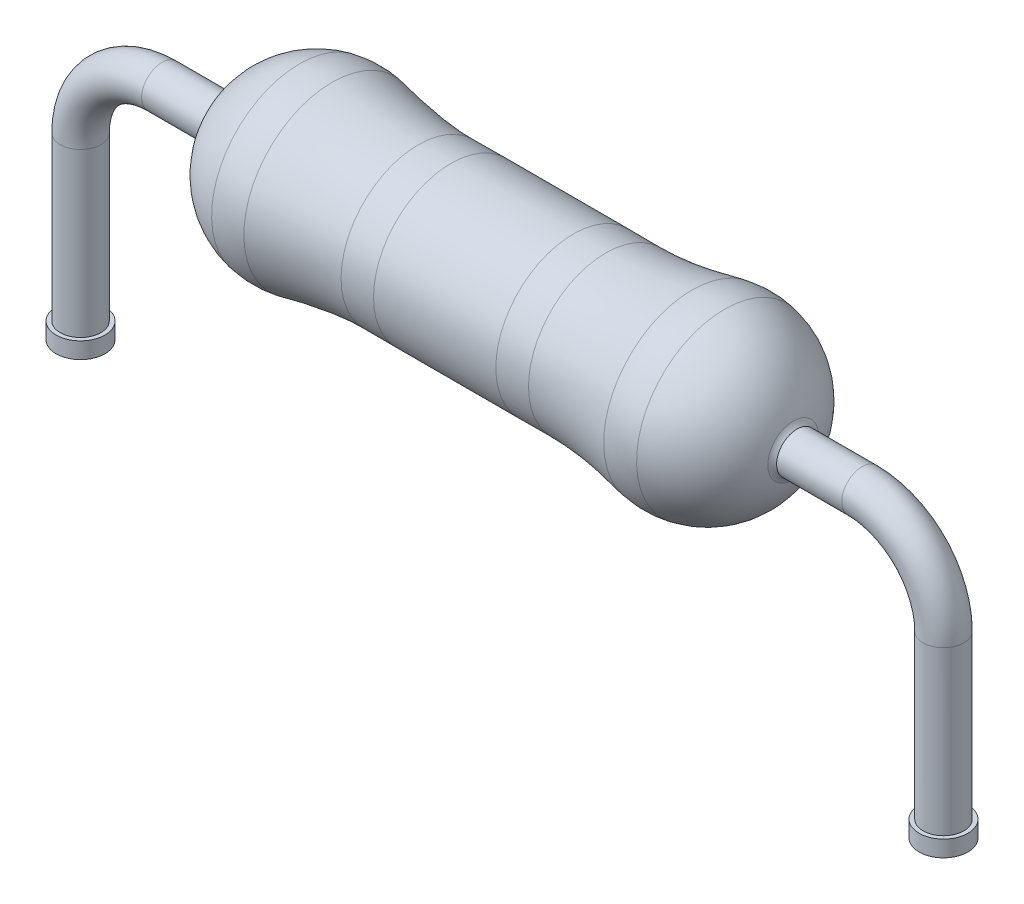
ISO-10303-21;
HEADER;
FILE_DESCRIPTION(('STEP AP214'),'2;1');
FILE_NAME('part.step','',(''),(''),'','','');
FILE_SCHEMA(('AUTOMOTIVE_DESIGN { 1 0 10303 214 1 1 1 1 }'));
ENDSEC;
DATA;
#1=APPLICATION_CONTEXT('core data for automotive mechanical design processes');
#2=APPLICATION_PROTOCOL_DEFINITION('international standard','automotive_design',2000,#1);
#3=PRODUCT_CONTEXT('',#1,'mechanical');
#4=PRODUCT('Part','Part','',(#3));
#5=PRODUCT_RELATED_PRODUCT_CATEGORY('part','',(#4));
#6=PRODUCT_DEFINITION_FORMATION('','',#4);
#7=PRODUCT_DEFINITION_CONTEXT('part definition',#1,'design');
#8=PRODUCT_DEFINITION('design','',#6,#7);
#9=PRODUCT_DEFINITION_SHAPE('','',#8);
#10=(LENGTH_UNIT() NAMED_UNIT(*) SI_UNIT(.MILLI.,.METRE.));
#11=(NAMED_UNIT(*) PLANE_ANGLE_UNIT() SI_UNIT($,.RADIAN.));
#12=(NAMED_UNIT(*) SI_UNIT($,.STERADIAN.) SOLID_ANGLE_UNIT());
#13=UNCERTAINTY_MEASURE_WITH_UNIT(LENGTH_MEASURE(1.E-05),#10,'distance_accuracy_value','');
#14=(GEOMETRIC_REPRESENTATION_CONTEXT(3) GLOBAL_UNCERTAINTY_ASSIGNED_CONTEXT((#13)) GLOBAL_UNIT_ASSIGNED_CONTEXT((#10,
#11,#12)) REPRESENTATION_CONTEXT('',''));
#15=CARTESIAN_POINT('',(0.,0.,0.));
#16=DIRECTION('',(0.,0.,1.));
#17=DIRECTION('',(1.,0.,0.));
#18=AXIS2_PLACEMENT_3D('',#15,#16,#17);
#19=CARTESIAN_POINT('',(-2.4,0.,0.));
#20=DIRECTION('',(-1.,0.,0.));
#21=DIRECTION('',(0.,1.,0.));
#22=AXIS2_PLACEMENT_3D('',#19,#20,#21);
#23=SPHERICAL_SURFACE('',#22,1.1);
#24=CARTESIAN_POINT('',(-3.45477255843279,0.,0.));
#25=DIRECTION('',(-1.,0.,0.));
#26=DIRECTION('',(0.,0.,1.));
#27=AXIS2_PLACEMENT_3D('',#24,#25,#26);
#28=CIRCLE('',#27,0.312177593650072);
#29=CARTESIAN_POINT('',(-3.45477255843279,0.312177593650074,0.));
#30=VERTEX_POINT('',#29);
#31=EDGE_CURVE('E58',#30,#30,#28,.T.);
#32=CARTESIAN_POINT('',(-2.61008625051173,0.,0.));
#33=DIRECTION('',(1.,0.,0.));
#34=DIRECTION('',(0.,1.,0.));
#35=AXIS2_PLACEMENT_3D('',#32,#33,#34);
#36=CIRCLE('',#35,1.07975171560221);
#37=CARTESIAN_POINT('',(-2.61008625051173,1.07975171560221,0.));
#38=VERTEX_POINT('',#37);
#39=EDGE_CURVE('E10',#38,#38,#36,.T.);
#40=CARTESIAN_POINT('',(-3.45477255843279,0.312177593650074,0.));
#41=CARTESIAN_POINT('',(-3.45122527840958,0.324163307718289,0.));
#42=CARTESIAN_POINT('',(-3.44747353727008,0.336088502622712,0.));
#43=CARTESIAN_POINT('',(-3.43956586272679,0.359804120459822,0.));
#44=CARTESIAN_POINT('',(-3.435409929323,0.371594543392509,0.));
#45=CARTESIAN_POINT('',(-3.42669860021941,0.395026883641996,0.));
#46=CARTESIAN_POINT('',(-3.42214320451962,0.406668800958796,0.));
#47=CARTESIAN_POINT('',(-3.41263827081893,0.429790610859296,0.));
#48=CARTESIAN_POINT('',(-3.40768873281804,0.441270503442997,0.));
#49=CARTESIAN_POINT('',(-3.39740125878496,0.464054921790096,0.));
#50=CARTESIAN_POINT('',(-3.39206332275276,0.475359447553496,0.));
#51=CARTESIAN_POINT('',(-3.38100525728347,0.497779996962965,0.));
#52=CARTESIAN_POINT('',(-3.37528512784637,0.508896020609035,0.));
#53=CARTESIAN_POINT('',(-3.36346932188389,0.530926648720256,0.));
#54=CARTESIAN_POINT('',(-3.3573736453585,0.541841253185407,0.));
#55=CARTESIAN_POINT('',(-3.34481382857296,0.563456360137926,0.));
#56=CARTESIAN_POINT('',(-3.3383496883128,0.574156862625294,0.));
#57=CARTESIAN_POINT('',(-3.32506045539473,0.595331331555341,0.));
#58=CARTESIAN_POINT('',(-3.31823536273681,0.605805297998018,0.));
#59=CARTESIAN_POINT('',(-3.30423215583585,0.626514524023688,0.));
#60=CARTESIAN_POINT('',(-3.29705404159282,0.63674978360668,0.));
#61=CARTESIAN_POINT('',(-3.28235313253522,0.65696970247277,0.));
#62=CARTESIAN_POINT('',(-3.27483033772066,0.666954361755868,0.));
#63=CARTESIAN_POINT('',(-3.25944880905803,0.686661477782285,0.));
#64=CARTESIAN_POINT('',(-3.25159007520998,0.696383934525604,0.));
#65=CARTESIAN_POINT('',(-3.23554580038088,0.715555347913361,0.));
#66=CARTESIAN_POINT('',(-3.22736025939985,0.7250043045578,0.));
#67=CARTESIAN_POINT('',(-3.21067188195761,0.743617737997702,0.));
#68=CARTESIAN_POINT('',(-3.20216904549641,0.752782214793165,0.));
#69=CARTESIAN_POINT('',(-3.18485595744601,0.770816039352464,0.));
#70=CARTESIAN_POINT('',(-3.17604570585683,0.7796853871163,0.));
#71=CARTESIAN_POINT('',(-3.1581280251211,0.797118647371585,0.));
#72=CARTESIAN_POINT('',(-3.14902059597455,0.805682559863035,0.));
#73=CARTESIAN_POINT('',(-3.13051914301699,0.822494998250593,0.));
#74=CARTESIAN_POINT('',(-3.12112511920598,0.830743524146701,0.));
#75=CARTESIAN_POINT('',(-3.10206139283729,0.846915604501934,0.));
#76=CARTESIAN_POINT('',(-3.09239169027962,0.854839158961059,0.));
#77=CARTESIAN_POINT('',(-3.07278784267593,0.870352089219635,0.));
#78=CARTESIAN_POINT('',(-3.06285369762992,0.877941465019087,0.));
#79=CARTESIAN_POINT('',(-3.04273250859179,0.892777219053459,0.));
#80=CARTESIAN_POINT('',(-3.03254546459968,0.900023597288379,0.));
#81=CARTESIAN_POINT('',(-3.01193031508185,0.914164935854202,0.));
#82=CARTESIAN_POINT('',(-3.00150220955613,0.921059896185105,0.));
#83=CARTESIAN_POINT('',(-2.98041705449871,0.934490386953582,0.));
#84=CARTESIAN_POINT('',(-2.96976000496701,0.941025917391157,0.));
#85=CARTESIAN_POINT('',(-2.9482293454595,0.953729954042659,0.));
#86=CARTESIAN_POINT('',(-2.93735573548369,0.959898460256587,0.));
#87=CARTESIAN_POINT('',(-2.91540459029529,0.971861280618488,0.));
#88=CARTESIAN_POINT('',(-2.9043270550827,0.977655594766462,0.));
#89=CARTESIAN_POINT('',(-2.8819809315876,0.988863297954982,0.));
#90=CARTESIAN_POINT('',(-2.87071234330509,0.994276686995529,0.));
#91=CARTESIAN_POINT('',(-2.84799720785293,1.00471624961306,0.));
#92=CARTESIAN_POINT('',(-2.83655066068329,1.00974242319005,0.));
#93=CARTESIAN_POINT('',(-2.81349290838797,1.0194017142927,0.));
#94=CARTESIAN_POINT('',(-2.80188170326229,1.02403483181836,0.));
#95=CARTESIAN_POINT('',(-2.77850812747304,1.03290262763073,0.));
#96=CARTESIAN_POINT('',(-2.76674575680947,1.03713730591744,0.));
#97=CARTESIAN_POINT('',(-2.7430835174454,1.04520330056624,0.));
#98=CARTESIAN_POINT('',(-2.7311836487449,1.04903461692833,0.));
#99=CARTESIAN_POINT('',(-2.70726024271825,1.05628944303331,0.));
#100=CARTESIAN_POINT('',(-2.6952367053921,1.05971295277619,0.));
#101=CARTESIAN_POINT('',(-2.67107992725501,1.06614816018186,0.));
#102=CARTESIAN_POINT('',(-2.65894668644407,1.06915985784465,0.));
#103=CARTESIAN_POINT('',(-2.63458462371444,1.07476804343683,0.));
#104=CARTESIAN_POINT('',(-2.62235580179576,1.07736453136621,0.));
#105=CARTESIAN_POINT('',(-2.61008625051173,1.07975171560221,0.));
#106=B_SPLINE_CURVE_WITH_KNOTS('',3,(#40,#41,#42,#43,#44,#45,#46,#47,#48,#49,#50,#51,#52,#53,
#54,#55,#56,#57,#58,#59,#60,#61,#62,#63,#64,#65,#66,#67,#68,#69,#70,#71,#72,#73,#74,#75,#76,#77,
#78,#79,#80,#81,#82,#83,#84,#85,#86,#87,#88,#89,#90,#91,#92,#93,#94,#95,#96,#97,#98,#99,#100,
#101,#102,#103,#104,#105),.UNSPECIFIED.,.F.,.F.,(4,2,2,2,2,2,2,2,2,2,2,2,2,2,2,2,2,2,2,2,2,2,2,
2,2,2,2,2,2,2,2,2,4),(0.,0.0374970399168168,0.0749940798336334,0.11249111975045,
0.149988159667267,0.187485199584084,0.2249822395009,0.262479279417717,0.299976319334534,
0.337473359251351,0.374970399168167,0.412467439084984,0.449964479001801,0.487461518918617,
0.524958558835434,0.562455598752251,0.599952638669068,0.637449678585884,0.674946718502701,
0.712443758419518,0.749940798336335,0.787437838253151,0.824934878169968,0.862431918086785,
0.899928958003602,0.937425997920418,0.974923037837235,1.01242007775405,1.04991711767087,
1.08741415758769,1.1249111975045,1.16240823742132,1.19990527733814),.UNSPECIFIED.);
#107=EDGE_CURVE('BSEAM35',#30,#38,#106,.T.);
#108=ORIENTED_EDGE('',*,*,#31,.F.);
#109=ORIENTED_EDGE('',*,*,#39,.F.);
#110=ORIENTED_EDGE('',*,*,#107,.T.);
#111=ORIENTED_EDGE('',*,*,#107,.F.);
#112=EDGE_LOOP('',(#108,#110,#109,#111));
#113=FACE_BOUND('',#112,.T.);
#114=ADVANCED_FACE('F35',(#113),#23,.T.);
#115=CARTESIAN_POINT('',(-0.751281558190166,0.95,0.));
#116=CARTESIAN_POINT('',(-0.922733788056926,0.954106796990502,0.));
#117=CARTESIAN_POINT('',(-1.41354099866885,0.927963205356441,0.));
#118=CARTESIAN_POINT('',(-1.89811743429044,1.01750246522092,0.));
#119=CARTESIAN_POINT('',(-2.21008625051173,1.08348178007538,0.));
#120=B_SPLINE_CURVE_WITH_KNOTS('',3,(#115,#116,#117,#118,#119),.UNSPECIFIED.,.F.,.F.,(4,1,4),
(0.,0.350784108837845,1.),.UNSPECIFIED.);
#121=CARTESIAN_POINT('',(-6.2236838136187,0.,0.));
#122=DIRECTION('',(-1.,0.,0.));
#123=AXIS1_PLACEMENT('',#121,#122);
#124=SURFACE_OF_REVOLUTION('',#120,#123);
#125=CARTESIAN_POINT('',(-2.21008625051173,0.,0.));
#126=DIRECTION('',(-1.,0.,0.));
#127=DIRECTION('',(0.,0.,1.));
#128=AXIS2_PLACEMENT_3D('',#125,#126,#127);
#129=CIRCLE('',#128,1.08348178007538);
#130=CARTESIAN_POINT('',(-2.21008625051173,1.08348178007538,0.));
#131=VERTEX_POINT('',#130);
#132=EDGE_CURVE('E63',#131,#131,#129,.T.);
#133=ORIENTED_EDGE('',*,*,#132,.F.);
#134=EDGE_LOOP('',(#133));
#135=FACE_BOUND('',#134,.T.);
#136=CARTESIAN_POINT('',(-1.15128155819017,0.,0.));
#137=DIRECTION('',(-1.,0.,0.));
#138=DIRECTION('',(0.,0.,1.));
#139=AXIS2_PLACEMENT_3D('',#136,#137,#138);
#140=CIRCLE('',#139,0.948430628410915);
#141=CARTESIAN_POINT('',(-1.15128155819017,0.,0.948430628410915));
#142=VERTEX_POINT('',#141);
#143=EDGE_CURVE('E45',#142,#142,#140,.F.);
#144=ORIENTED_EDGE('',*,*,#143,.F.);
#145=EDGE_LOOP('',(#144));
#146=FACE_BOUND('',#145,.T.);
#147=ADVANCED_FACE('F113',(#135,#146),#124,.T.);
#148=CARTESIAN_POINT('',(2.21008625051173,1.08348178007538,0.));
#149=CARTESIAN_POINT('',(1.89811743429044,1.01750246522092,0.));
#150=CARTESIAN_POINT('',(1.41354099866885,0.927963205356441,0.));
#151=CARTESIAN_POINT('',(0.922733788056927,0.954106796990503,0.));
#152=CARTESIAN_POINT('',(0.751281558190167,0.95,0.));
#153=B_SPLINE_CURVE_WITH_KNOTS('',3,(#148,#149,#150,#151,#152),.UNSPECIFIED.,.F.,.F.,(4,1,4),
(0.,0.649215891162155,1.),.UNSPECIFIED.);
#154=CARTESIAN_POINT('',(-6.2236838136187,0.,0.));
#155=DIRECTION('',(-1.,0.,0.));
#156=AXIS1_PLACEMENT('',#154,#155);
#157=SURFACE_OF_REVOLUTION('',#153,#156);
#158=CARTESIAN_POINT('',(2.21008625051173,0.,0.));
#159=DIRECTION('',(-1.,0.,0.));
#160=DIRECTION('',(0.,0.,1.));
#161=AXIS2_PLACEMENT_3D('',#158,#159,#160);
#162=CIRCLE('',#161,1.08348178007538);
#163=CARTESIAN_POINT('',(2.21008625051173,1.08348178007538,0.));
#164=VERTEX_POINT('',#163);
#165=EDGE_CURVE('E146',#164,#164,#162,.T.);
#166=ORIENTED_EDGE('',*,*,#165,.T.);
#167=EDGE_LOOP('',(#166));
#168=FACE_BOUND('',#167,.T.);
#169=CARTESIAN_POINT('',(1.15128155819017,0.,0.));
#170=DIRECTION('',(-1.,0.,0.));
#171=DIRECTION('',(0.,0.,1.));
#172=AXIS2_PLACEMENT_3D('',#169,#170,#171);
#173=CIRCLE('',#172,0.948430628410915);
#174=CARTESIAN_POINT('',(1.15128155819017,0.,0.948430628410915));
#175=VERTEX_POINT('',#174);
#176=EDGE_CURVE('E53',#175,#175,#173,.T.);
#177=ORIENTED_EDGE('',*,*,#176,.F.);
#178=EDGE_LOOP('',(#177));
#179=FACE_BOUND('',#178,.T.);
#180=ADVANCED_FACE('F99',(#168,#179),#157,.T.);
#181=CARTESIAN_POINT('',(2.4,0.,0.));
#182=DIRECTION('',(-1.,0.,0.));
#183=DIRECTION('',(0.,1.,0.));
#184=AXIS2_PLACEMENT_3D('',#181,#182,#183);
#185=SPHERICAL_SURFACE('',#184,1.1);
#186=CARTESIAN_POINT('',(3.45477255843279,0.,0.));
#187=DIRECTION('',(-1.,0.,0.));
#188=DIRECTION('',(0.,0.,1.));
#189=AXIS2_PLACEMENT_3D('',#186,#187,#188);
#190=CIRCLE('',#189,0.312177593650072);
#191=CARTESIAN_POINT('',(3.45477255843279,0.312177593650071,0.));
#192=VERTEX_POINT('',#191);
#193=EDGE_CURVE('E149',#192,#192,#190,.T.);
#194=CARTESIAN_POINT('',(2.61008625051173,0.,0.));
#195=DIRECTION('',(-1.,0.,0.));
#196=DIRECTION('',(0.,-1.,0.));
#197=AXIS2_PLACEMENT_3D('',#194,#195,#196);
#198=CIRCLE('',#197,1.07975171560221);
#199=CARTESIAN_POINT('',(2.61008625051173,1.07975171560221,0.));
#200=VERTEX_POINT('',#199);
#201=EDGE_CURVE('E152',#200,#200,#198,.T.);
#202=CARTESIAN_POINT('',(3.45477255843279,0.312177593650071,0.));
#203=CARTESIAN_POINT('',(3.45122527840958,0.324163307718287,0.));
#204=CARTESIAN_POINT('',(3.44747353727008,0.33608850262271,0.));
#205=CARTESIAN_POINT('',(3.43956586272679,0.35980412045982,0.));
#206=CARTESIAN_POINT('',(3.435409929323,0.371594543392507,0.));
#207=CARTESIAN_POINT('',(3.42669860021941,0.395026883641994,0.));
#208=CARTESIAN_POINT('',(3.42214320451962,0.406668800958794,0.));
#209=CARTESIAN_POINT('',(3.41263827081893,0.429790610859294,0.));
#210=CARTESIAN_POINT('',(3.40768873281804,0.441270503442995,0.));
#211=CARTESIAN_POINT('',(3.39740125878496,0.464054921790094,0.));
#212=CARTESIAN_POINT('',(3.39206332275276,0.475359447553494,0.));
#213=CARTESIAN_POINT('',(3.38100525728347,0.497779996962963,0.));
#214=CARTESIAN_POINT('',(3.37528512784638,0.508896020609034,0.));
#215=CARTESIAN_POINT('',(3.36346932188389,0.530926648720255,0.));
#216=CARTESIAN_POINT('',(3.3573736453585,0.541841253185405,0.));
#217=CARTESIAN_POINT('',(3.34481382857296,0.563456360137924,0.));
#218=CARTESIAN_POINT('',(3.3383496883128,0.574156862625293,0.));
#219=CARTESIAN_POINT('',(3.32506045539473,0.595331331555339,0.));
#220=CARTESIAN_POINT('',(3.31823536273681,0.605805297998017,0.));
#221=CARTESIAN_POINT('',(3.30423215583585,0.626514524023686,0.));
#222=CARTESIAN_POINT('',(3.29705404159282,0.636749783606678,0.));
#223=CARTESIAN_POINT('',(3.28235313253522,0.656969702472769,0.));
#224=CARTESIAN_POINT('',(3.27483033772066,0.666954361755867,0.));
#225=CARTESIAN_POINT('',(3.25944880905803,0.686661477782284,0.));
#226=CARTESIAN_POINT('',(3.25159007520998,0.696383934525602,0.));
#227=CARTESIAN_POINT('',(3.23554580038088,0.71555534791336,0.));
#228=CARTESIAN_POINT('',(3.22736025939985,0.725004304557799,0.));
#229=CARTESIAN_POINT('',(3.21067188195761,0.743617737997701,0.));
#230=CARTESIAN_POINT('',(3.20216904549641,0.752782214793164,0.));
#231=CARTESIAN_POINT('',(3.18485595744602,0.770816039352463,0.));
#232=CARTESIAN_POINT('',(3.17604570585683,0.779685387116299,0.));
#233=CARTESIAN_POINT('',(3.1581280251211,0.797118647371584,0.));
#234=CARTESIAN_POINT('',(3.14902059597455,0.805682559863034,0.));
#235=CARTESIAN_POINT('',(3.13051914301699,0.822494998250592,0.));
#236=CARTESIAN_POINT('',(3.12112511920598,0.8307435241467,0.));
#237=CARTESIAN_POINT('',(3.1020613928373,0.846915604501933,0.));
#238=CARTESIAN_POINT('',(3.09239169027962,0.854839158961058,0.));
#239=CARTESIAN_POINT('',(3.07278784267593,0.870352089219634,0.));
#240=CARTESIAN_POINT('',(3.06285369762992,0.877941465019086,0.));
#241=CARTESIAN_POINT('',(3.04273250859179,0.892777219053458,0.));
#242=CARTESIAN_POINT('',(3.03254546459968,0.900023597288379,0.));
#243=CARTESIAN_POINT('',(3.01193031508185,0.914164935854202,0.));
#244=CARTESIAN_POINT('',(3.00150220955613,0.921059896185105,0.));
#245=CARTESIAN_POINT('',(2.98041705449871,0.934490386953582,0.));
#246=CARTESIAN_POINT('',(2.96976000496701,0.941025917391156,0.));
#247=CARTESIAN_POINT('',(2.9482293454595,0.953729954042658,0.));
#248=CARTESIAN_POINT('',(2.93735573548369,0.959898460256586,0.));
#249=CARTESIAN_POINT('',(2.91540459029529,0.971861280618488,0.));
#250=CARTESIAN_POINT('',(2.9043270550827,0.977655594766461,0.));
#251=CARTESIAN_POINT('',(2.8819809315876,0.988863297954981,0.));
#252=CARTESIAN_POINT('',(2.87071234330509,0.994276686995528,0.));
#253=CARTESIAN_POINT('',(2.84799720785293,1.00471624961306,0.));
#254=CARTESIAN_POINT('',(2.83655066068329,1.00974242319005,0.));
#255=CARTESIAN_POINT('',(2.81349290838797,1.0194017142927,0.));
#256=CARTESIAN_POINT('',(2.80188170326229,1.02403483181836,0.));
#257=CARTESIAN_POINT('',(2.77850812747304,1.03290262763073,0.));
#258=CARTESIAN_POINT('',(2.76674575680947,1.03713730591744,0.));
#259=CARTESIAN_POINT('',(2.7430835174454,1.04520330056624,0.));
#260=CARTESIAN_POINT('',(2.7311836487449,1.04903461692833,0.));
#261=CARTESIAN_POINT('',(2.70726024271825,1.05628944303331,0.));
#262=CARTESIAN_POINT('',(2.6952367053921,1.05971295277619,0.));
#263=CARTESIAN_POINT('',(2.67107992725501,1.06614816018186,0.));
#264=CARTESIAN_POINT('',(2.65894668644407,1.06915985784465,0.));
#265=CARTESIAN_POINT('',(2.63458462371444,1.07476804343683,0.));
#266=CARTESIAN_POINT('',(2.62235580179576,1.07736453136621,0.));
#267=CARTESIAN_POINT('',(2.61008625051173,1.07975171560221,0.));
#268=B_SPLINE_CURVE_WITH_KNOTS('',3,(#202,#203,#204,#205,#206,#207,#208,#209,#210,#211,#212,
#213,#214,#215,#216,#217,#218,#219,#220,#221,#222,#223,#224,#225,#226,#227,#228,#229,#230,#231,
#232,#233,#234,#235,#236,#237,#238,#239,#240,#241,#242,#243,#244,#245,#246,#247,#248,#249,#250,
#251,#252,#253,#254,#255,#256,#257,#258,#259,#260,#261,#262,#263,#264,#265,#266,#267),
.UNSPECIFIED.,.F.,.F.,(4,2,2,2,2,2,2,2,2,2,2,2,2,2,2,2,2,2,2,2,2,2,2,2,2,2,2,2,2,2,2,2,4),(0.,
0.0374970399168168,0.0749940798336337,0.11249111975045,0.149988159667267,0.187485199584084,
0.224982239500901,0.262479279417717,0.299976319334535,0.337473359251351,0.374970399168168,
0.412467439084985,0.449964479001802,0.487461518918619,0.524958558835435,0.562455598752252,
0.599952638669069,0.637449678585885,0.674946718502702,0.712443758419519,0.749940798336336,
0.787437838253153,0.824934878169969,0.862431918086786,0.899928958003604,0.93742599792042,
0.974923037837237,1.01242007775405,1.04991711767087,1.08741415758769,1.1249111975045,
1.16240823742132,1.19990527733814),.UNSPECIFIED.);
#269=EDGE_CURVE('BSEAM103',#192,#200,#268,.T.);
#270=ORIENTED_EDGE('',*,*,#193,.T.);
#271=ORIENTED_EDGE('',*,*,#201,.F.);
#272=ORIENTED_EDGE('',*,*,#269,.T.);
#273=ORIENTED_EDGE('',*,*,#269,.F.);
#274=EDGE_LOOP('',(#270,#272,#271,#273));
#275=FACE_BOUND('',#274,.T.);
#276=ADVANCED_FACE('F103',(#275),#185,.T.);
#277=CARTESIAN_POINT('',(3.5,0.250000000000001,0.));
#278=CARTESIAN_POINT('',(3.47134460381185,0.276701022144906,0.));
#279=CARTESIAN_POINT('',(3.45477255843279,0.312177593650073,0.));
#280=B_SPLINE_CURVE_WITH_KNOTS('',2,(#277,#278,#279),.UNSPECIFIED.,.F.,.F.,(3,3),(0.,1.),.UNSPECIFIED.);
#281=CARTESIAN_POINT('',(-6.2236838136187,0.,0.));
#282=DIRECTION('',(-1.,0.,0.));
#283=AXIS1_PLACEMENT('',#281,#282);
#284=SURFACE_OF_REVOLUTION('',#280,#283);
#285=ORIENTED_EDGE('',*,*,#193,.F.);
#286=EDGE_LOOP('',(#285));
#287=FACE_BOUND('',#286,.T.);
#288=CARTESIAN_POINT('',(3.5,0.,0.));
#289=DIRECTION('',(1.,0.,0.));
#290=DIRECTION('',(0.,0.,-1.));
#291=AXIS2_PLACEMENT_3D('',#288,#289,#290);
#292=CIRCLE('',#291,0.25);
#293=CARTESIAN_POINT('',(3.5,0.,-0.25));
#294=VERTEX_POINT('',#293);
#295=EDGE_CURVE('E40',#294,#294,#292,.T.);
#296=ORIENTED_EDGE('',*,*,#295,.F.);
#297=EDGE_LOOP('',(#296));
#298=FACE_BOUND('',#297,.T.);
#299=ADVANCED_FACE('F37',(#287,#298),#284,.T.);
#300=CARTESIAN_POINT('',(2.61008625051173,1.07975171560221,0.));
#301=CARTESIAN_POINT('',(2.60597322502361,1.08055198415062,0.));
#302=CARTESIAN_POINT('',(2.6018556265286,1.08132874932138,0.));
#303=CARTESIAN_POINT('',(2.59361182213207,1.08283517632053,0.));
#304=CARTESIAN_POINT('',(2.58948561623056,1.08356483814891,0.));
#305=CARTESIAN_POINT('',(2.58122513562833,1.08497696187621,0.));
#306=CARTESIAN_POINT('',(2.57709086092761,1.08565942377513,0.));
#307=CARTESIAN_POINT('',(2.56881478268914,1.0869770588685,0.));
#308=CARTESIAN_POINT('',(2.5646729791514,1.08761223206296,0.));
#309=CARTESIAN_POINT('',(2.55638238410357,1.08883520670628,0.));
#310=CARTESIAN_POINT('',(2.55223359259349,1.08942300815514,0.));
#311=CARTESIAN_POINT('',(2.54392956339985,1.09055116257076,0.));
#312=CARTESIAN_POINT('',(2.53977432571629,1.09109151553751,0.));
#313=CARTESIAN_POINT('',(2.5314579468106,1.09212470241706,0.));
#314=CARTESIAN_POINT('',(2.52729680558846,1.09261753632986,0.));
#315=CARTESIAN_POINT('',(2.51896916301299,1.09355562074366,0.));
#316=CARTESIAN_POINT('',(2.51480266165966,1.09400087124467,0.));
#317=CARTESIAN_POINT('',(2.50646484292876,1.09484373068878,0.));
#318=CARTESIAN_POINT('',(2.50229352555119,1.09524133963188,0.));
#319=CARTESIAN_POINT('',(2.49394661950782,1.09598886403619,0.));
#320=CARTESIAN_POINT('',(2.48977103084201,1.09633877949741,0.));
#321=CARTESIAN_POINT('',(2.48141612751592,1.09699087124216,0.));
#322=CARTESIAN_POINT('',(2.47723681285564,1.09729304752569,0.));
#323=CARTESIAN_POINT('',(2.46887500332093,1.09784962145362,0.));
#324=CARTESIAN_POINT('',(2.46469250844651,1.09810401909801,0.));
#325=CARTESIAN_POINT('',(2.4563248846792,1.09856500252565,0.));
#326=CARTESIAN_POINT('',(2.4521397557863,1.0987715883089,0.));
#327=CARTESIAN_POINT('',(2.44376741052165,1.09913692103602,0.));
#328=CARTESIAN_POINT('',(2.43958019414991,1.0992956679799,0.));
#329=CARTESIAN_POINT('',(2.4312042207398,1.09956530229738,0.));
#330=CARTESIAN_POINT('',(2.42701546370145,1.09967618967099,0.));
#331=CARTESIAN_POINT('',(2.41863695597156,1.09985009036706,0.));
#332=CARTESIAN_POINT('',(2.41444720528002,1.09991310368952,0.));
#333=CARTESIAN_POINT('',(2.40606725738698,1.09999124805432,0.));
#334=CARTESIAN_POINT('',(2.40187706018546,1.10000637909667,0.));
#335=CARTESIAN_POINT('',(2.39349676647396,1.09998875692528,0.));
#336=CARTESIAN_POINT('',(2.38930666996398,1.09995600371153,0.));
#337=CARTESIAN_POINT('',(2.38092712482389,1.09984261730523,0.));
#338=CARTESIAN_POINT('',(2.37673767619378,1.09976198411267,0.));
#339=CARTESIAN_POINT('',(2.36835997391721,1.09955284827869,0.));
#340=CARTESIAN_POINT('',(2.36417172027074,1.09942434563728,0.));
#341=CARTESIAN_POINT('',(2.35579695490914,1.09911948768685,0.));
#342=CARTESIAN_POINT('',(2.351610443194,1.09894313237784,0.));
#343=CARTESIAN_POINT('',(2.34323970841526,1.09854259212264,0.));
#344=CARTESIAN_POINT('',(2.33905548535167,1.09831840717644,0.));
#345=CARTESIAN_POINT('',(2.33068987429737,1.09782223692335,0.));
#346=CARTESIAN_POINT('',(2.32650848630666,1.09755025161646,0.));
#347=CARTESIAN_POINT('',(2.31814909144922,1.09695851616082,0.));
#348=CARTESIAN_POINT('',(2.3139710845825,1.09663876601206,0.));
#349=CARTESIAN_POINT('',(2.30561899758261,1.09595154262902,0.));
#350=CARTESIAN_POINT('',(2.30144491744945,1.09558406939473,0.));
#351=CARTESIAN_POINT('',(2.29310122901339,1.09480144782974,0.));
#352=CARTESIAN_POINT('',(2.28893162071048,1.09438629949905,0.));
#353=CARTESIAN_POINT('',(2.28059742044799,1.09350838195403,0.));
#354=CARTESIAN_POINT('',(2.27643282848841,1.09304561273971,0.));
#355=CARTESIAN_POINT('',(2.26810920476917,1.0920725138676,0.));
#356=CARTESIAN_POINT('',(2.26395017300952,1.09156218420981,0.));
#357=CARTESIAN_POINT('',(2.25563821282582,1.09049403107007,0.));
#358=CARTESIAN_POINT('',(2.25148528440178,1.08993620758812,0.));
#359=CARTESIAN_POINT('',(2.24318607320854,1.08877313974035,0.));
#360=CARTESIAN_POINT('',(2.23903979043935,1.08816789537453,0.));
#361=CARTESIAN_POINT('',(2.23075441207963,1.08691006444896,0.));
#362=CARTESIAN_POINT('',(2.2266153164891,1.08625747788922,0.));
#363=CARTESIAN_POINT('',(2.21834485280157,1.08490504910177,0.));
#364=CARTESIAN_POINT('',(2.21421348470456,1.08420520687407,0.));
#365=CARTESIAN_POINT('',(2.21008625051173,1.08348178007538,0.));
#366=B_SPLINE_CURVE_WITH_KNOTS('',3,(#300,#301,#302,#303,#304,#305,#306,#307,#308,#309,#310,
#311,#312,#313,#314,#315,#316,#317,#318,#319,#320,#321,#322,#323,#324,#325,#326,#327,#328,#329,
#330,#331,#332,#333,#334,#335,#336,#337,#338,#339,#340,#341,#342,#343,#344,#345,#346,#347,#348,
#349,#350,#351,#352,#353,#354,#355,#356,#357,#358,#359,#360,#361,#362,#363,#364,#365),
.UNSPECIFIED.,.F.,.F.,(4,2,2,2,2,2,2,2,2,2,2,2,2,2,2,2,2,2,2,2,2,2,2,2,2,2,2,2,2,2,2,2,4),(0.,
0.0125703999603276,0.0251407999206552,0.0377111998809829,0.0502815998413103,0.0628519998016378,
0.0754223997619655,0.087992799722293,0.10056319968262,0.113133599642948,0.125703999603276,
0.138274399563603,0.150844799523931,0.163415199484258,0.175985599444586,0.188555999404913,
0.201126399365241,0.213696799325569,0.226267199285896,0.238837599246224,0.251407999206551,
0.263978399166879,0.276548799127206,0.289119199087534,0.301689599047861,0.314259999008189,
0.326830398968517,0.339400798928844,0.351971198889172,0.364541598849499,0.377111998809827,
0.389682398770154,0.402252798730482),.UNSPECIFIED.);
#367=EDGE_CURVE('BSEAM97',#200,#164,#366,.T.);
#368=ORIENTED_EDGE('',*,*,#201,.T.);
#369=ORIENTED_EDGE('',*,*,#165,.F.);
#370=ORIENTED_EDGE('',*,*,#367,.T.);
#371=ORIENTED_EDGE('',*,*,#367,.F.);
#372=EDGE_LOOP('',(#368,#370,#369,#371));
#373=FACE_BOUND('',#372,.T.);
#374=ADVANCED_FACE('F97',(#373),#185,.T.);
#375=ORIENTED_EDGE('',*,*,#176,.T.);
#376=EDGE_LOOP('',(#375));
#377=FACE_BOUND('',#376,.T.);
#378=CARTESIAN_POINT('',(0.751281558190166,0.,0.));
#379=DIRECTION('',(-1.,0.,0.));
#380=DIRECTION('',(0.,0.,1.));
#381=AXIS2_PLACEMENT_3D('',#378,#379,#380);
#382=CIRCLE('',#381,0.95);
#383=CARTESIAN_POINT('',(0.751281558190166,0.,0.95));
#384=VERTEX_POINT('',#383);
#385=EDGE_CURVE('E141',#384,#384,#382,.T.);
#386=ORIENTED_EDGE('',*,*,#385,.F.);
#387=EDGE_LOOP('',(#386));
#388=FACE_BOUND('',#387,.T.);
#389=ADVANCED_FACE('F93',(#377,#388),#157,.T.);
#390=CARTESIAN_POINT('',(-6.2236838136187,0.,0.));
#391=DIRECTION('',(-1.,0.,0.));
#392=DIRECTION('',(0.,0.,1.));
#393=AXIS2_PLACEMENT_3D('',#390,#391,#392);
#394=CYLINDRICAL_SURFACE('',#393,0.95);
#395=CARTESIAN_POINT('',(-0.751281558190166,0.,0.));
#396=DIRECTION('',(-1.,0.,0.));
#397=DIRECTION('',(0.,0.,1.));
#398=AXIS2_PLACEMENT_3D('',#395,#396,#397);
#399=CIRCLE('',#398,0.95);
#400=CARTESIAN_POINT('',(-0.751281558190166,0.,0.95));
#401=VERTEX_POINT('',#400);
#402=EDGE_CURVE('E138',#401,#401,#399,.T.);
#403=ORIENTED_EDGE('',*,*,#402,.F.);
#404=EDGE_LOOP('',(#403));
#405=FACE_BOUND('',#404,.T.);
#406=ORIENTED_EDGE('',*,*,#385,.T.);
#407=EDGE_LOOP('',(#406));
#408=FACE_BOUND('',#407,.T.);
#409=ADVANCED_FACE('F96',(#405,#408),#394,.T.);
#410=ORIENTED_EDGE('',*,*,#143,.T.);
#411=EDGE_LOOP('',(#410));
#412=FACE_BOUND('',#411,.T.);
#413=ORIENTED_EDGE('',*,*,#402,.T.);
#414=EDGE_LOOP('',(#413));
#415=FACE_BOUND('',#414,.T.);
#416=ADVANCED_FACE('F121',(#412,#415),#124,.T.);
#417=CARTESIAN_POINT('',(-2.61008625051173,1.07975171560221,0.));
#418=CARTESIAN_POINT('',(-2.60597322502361,1.08055198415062,0.));
#419=CARTESIAN_POINT('',(-2.6018556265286,1.08132874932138,0.));
#420=CARTESIAN_POINT('',(-2.59361182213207,1.08283517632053,0.));
#421=CARTESIAN_POINT('',(-2.58948561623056,1.08356483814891,0.));
#422=CARTESIAN_POINT('',(-2.58122513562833,1.08497696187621,0.));
#423=CARTESIAN_POINT('',(-2.57709086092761,1.08565942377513,0.));
#424=CARTESIAN_POINT('',(-2.56881478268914,1.0869770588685,0.));
#425=CARTESIAN_POINT('',(-2.5646729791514,1.08761223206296,0.));
#426=CARTESIAN_POINT('',(-2.55638238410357,1.08883520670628,0.));
#427=CARTESIAN_POINT('',(-2.55223359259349,1.08942300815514,0.));
#428=CARTESIAN_POINT('',(-2.54392956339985,1.09055116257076,0.));
#429=CARTESIAN_POINT('',(-2.53977432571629,1.09109151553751,0.));
#430=CARTESIAN_POINT('',(-2.5314579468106,1.09212470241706,0.));
#431=CARTESIAN_POINT('',(-2.52729680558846,1.09261753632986,0.));
#432=CARTESIAN_POINT('',(-2.51896916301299,1.09355562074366,0.));
#433=CARTESIAN_POINT('',(-2.51480266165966,1.09400087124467,0.));
#434=CARTESIAN_POINT('',(-2.50646484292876,1.09484373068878,0.));
#435=CARTESIAN_POINT('',(-2.50229352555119,1.09524133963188,0.));
#436=CARTESIAN_POINT('',(-2.49394661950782,1.09598886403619,0.));
#437=CARTESIAN_POINT('',(-2.48977103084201,1.09633877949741,0.));
#438=CARTESIAN_POINT('',(-2.48141612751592,1.09699087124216,0.));
#439=CARTESIAN_POINT('',(-2.47723681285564,1.09729304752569,0.));
#440=CARTESIAN_POINT('',(-2.46887500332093,1.09784962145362,0.));
#441=CARTESIAN_POINT('',(-2.46469250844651,1.09810401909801,0.));
#442=CARTESIAN_POINT('',(-2.45632488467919,1.09856500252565,0.));
#443=CARTESIAN_POINT('',(-2.4521397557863,1.0987715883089,0.));
#444=CARTESIAN_POINT('',(-2.44376741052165,1.09913692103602,0.));
#445=CARTESIAN_POINT('',(-2.43958019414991,1.0992956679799,0.));
#446=CARTESIAN_POINT('',(-2.4312042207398,1.09956530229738,0.));
#447=CARTESIAN_POINT('',(-2.42701546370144,1.09967618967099,0.));
#448=CARTESIAN_POINT('',(-2.41863695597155,1.09985009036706,0.));
#449=CARTESIAN_POINT('',(-2.41444720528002,1.09991310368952,0.));
#450=CARTESIAN_POINT('',(-2.40606725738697,1.09999124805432,0.));
#451=CARTESIAN_POINT('',(-2.40187706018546,1.10000637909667,0.));
#452=CARTESIAN_POINT('',(-2.39349676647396,1.09998875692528,0.));
#453=CARTESIAN_POINT('',(-2.38930666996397,1.09995600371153,0.));
#454=CARTESIAN_POINT('',(-2.38092712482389,1.09984261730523,0.));
#455=CARTESIAN_POINT('',(-2.37673767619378,1.09976198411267,0.));
#456=CARTESIAN_POINT('',(-2.36835997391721,1.09955284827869,0.));
#457=CARTESIAN_POINT('',(-2.36417172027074,1.09942434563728,0.));
#458=CARTESIAN_POINT('',(-2.35579695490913,1.09911948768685,0.));
#459=CARTESIAN_POINT('',(-2.351610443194,1.09894313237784,0.));
#460=CARTESIAN_POINT('',(-2.34323970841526,1.09854259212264,0.));
#461=CARTESIAN_POINT('',(-2.33905548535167,1.09831840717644,0.));
#462=CARTESIAN_POINT('',(-2.33068987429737,1.09782223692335,0.));
#463=CARTESIAN_POINT('',(-2.32650848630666,1.09755025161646,0.));
#464=CARTESIAN_POINT('',(-2.31814909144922,1.09695851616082,0.));
#465=CARTESIAN_POINT('',(-2.3139710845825,1.09663876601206,0.));
#466=CARTESIAN_POINT('',(-2.30561899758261,1.09595154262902,0.));
#467=CARTESIAN_POINT('',(-2.30144491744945,1.09558406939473,0.));
#468=CARTESIAN_POINT('',(-2.29310122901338,1.09480144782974,0.));
#469=CARTESIAN_POINT('',(-2.28893162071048,1.09438629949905,0.));
#470=CARTESIAN_POINT('',(-2.28059742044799,1.09350838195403,0.));
#471=CARTESIAN_POINT('',(-2.27643282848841,1.09304561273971,0.));
#472=CARTESIAN_POINT('',(-2.26810920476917,1.0920725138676,0.));
#473=CARTESIAN_POINT('',(-2.26395017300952,1.09156218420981,0.));
#474=CARTESIAN_POINT('',(-2.25563821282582,1.09049403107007,0.));
#475=CARTESIAN_POINT('',(-2.25148528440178,1.08993620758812,0.));
#476=CARTESIAN_POINT('',(-2.24318607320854,1.08877313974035,0.));
#477=CARTESIAN_POINT('',(-2.23903979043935,1.08816789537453,0.));
#478=CARTESIAN_POINT('',(-2.23075441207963,1.08691006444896,0.));
#479=CARTESIAN_POINT('',(-2.2266153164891,1.08625747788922,0.));
#480=CARTESIAN_POINT('',(-2.21834485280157,1.08490504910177,0.));
#481=CARTESIAN_POINT('',(-2.21421348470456,1.08420520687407,0.));
#482=CARTESIAN_POINT('',(-2.21008625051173,1.08348178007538,0.));
#483=B_SPLINE_CURVE_WITH_KNOTS('',3,(#417,#418,#419,#420,#421,#422,#423,#424,#425,#426,#427,
#428,#429,#430,#431,#432,#433,#434,#435,#436,#437,#438,#439,#440,#441,#442,#443,#444,#445,#446,
#447,#448,#449,#450,#451,#452,#453,#454,#455,#456,#457,#458,#459,#460,#461,#462,#463,#464,#465,
#466,#467,#468,#469,#470,#471,#472,#473,#474,#475,#476,#477,#478,#479,#480,#481,#482),
.UNSPECIFIED.,.F.,.F.,(4,2,2,2,2,2,2,2,2,2,2,2,2,2,2,2,2,2,2,2,2,2,2,2,2,2,2,2,2,2,2,2,4),(0.,
0.0125703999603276,0.0251407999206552,0.0377111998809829,0.0502815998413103,0.0628519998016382,
0.0754223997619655,0.087992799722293,0.100563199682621,0.113133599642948,0.125703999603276,
0.138274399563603,0.150844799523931,0.163415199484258,0.175985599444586,0.188555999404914,
0.201126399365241,0.213696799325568,0.226267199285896,0.238837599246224,0.251407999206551,
0.263978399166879,0.276548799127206,0.289119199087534,0.301689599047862,0.314259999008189,
0.326830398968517,0.339400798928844,0.351971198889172,0.364541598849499,0.377111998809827,
0.389682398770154,0.402252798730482),.UNSPECIFIED.);
#484=EDGE_CURVE('BSEAM116',#38,#131,#483,.T.);
#485=ORIENTED_EDGE('',*,*,#39,.T.);
#486=ORIENTED_EDGE('',*,*,#132,.T.);
#487=ORIENTED_EDGE('',*,*,#484,.T.);
#488=ORIENTED_EDGE('',*,*,#484,.F.);
#489=EDGE_LOOP('',(#485,#487,#486,#488));
#490=FACE_BOUND('',#489,.T.);
#491=ADVANCED_FACE('F116',(#490),#23,.T.);
#492=CARTESIAN_POINT('',(-3.45477255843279,0.312177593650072,0.));
#493=CARTESIAN_POINT('',(-3.47134460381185,0.276701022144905,0.));
#494=CARTESIAN_POINT('',(-3.5,0.25,0.));
#495=B_SPLINE_CURVE_WITH_KNOTS('',2,(#492,#493,#494),.UNSPECIFIED.,.F.,.F.,(3,3),(0.,1.),.UNSPECIFIED.);
#496=CARTESIAN_POINT('',(-6.2236838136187,0.,0.));
#497=DIRECTION('',(-1.,0.,0.));
#498=AXIS1_PLACEMENT('',#496,#497);
#499=SURFACE_OF_REVOLUTION('',#495,#498);
#500=CARTESIAN_POINT('',(-3.5,0.,0.));
#501=DIRECTION('',(-1.,0.,0.));
#502=DIRECTION('',(0.,0.,1.));
#503=AXIS2_PLACEMENT_3D('',#500,#501,#502);
#504=CIRCLE('',#503,0.25);
#505=CARTESIAN_POINT('',(-3.5,0.,0.25));
#506=VERTEX_POINT('',#505);
#507=EDGE_CURVE('E56',#506,#506,#504,.T.);
#508=ORIENTED_EDGE('',*,*,#507,.F.);
#509=EDGE_LOOP('',(#508));
#510=FACE_BOUND('',#509,.T.);
#511=ORIENTED_EDGE('',*,*,#31,.T.);
#512=EDGE_LOOP('',(#511));
#513=FACE_BOUND('',#512,.T.);
#514=ADVANCED_FACE('F126',(#510,#513),#499,.T.);
#515=CARTESIAN_POINT('',(-3.5,0.,0.));
#516=DIRECTION('',(-1.,0.,0.));
#517=DIRECTION('',(0.,-1.,0.));
#518=AXIS2_PLACEMENT_3D('',#515,#516,#517);
#519=CYLINDRICAL_SURFACE('',#518,0.25);
#520=CARTESIAN_POINT('',(-4.29999999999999,0.,0.));
#521=DIRECTION('',(-1.,0.,0.));
#522=DIRECTION('',(0.,0.,1.));
#523=AXIS2_PLACEMENT_3D('',#520,#521,#522);
#524=CIRCLE('',#523,0.25);
#525=CARTESIAN_POINT('',(-4.29999999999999,0.249999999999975,0.));
#526=VERTEX_POINT('',#525);
#527=EDGE_CURVE('E71',#526,#526,#524,.T.);
#528=ORIENTED_EDGE('',*,*,#527,.F.);
#529=EDGE_LOOP('',(#528));
#530=FACE_BOUND('',#529,.T.);
#531=ORIENTED_EDGE('',*,*,#507,.T.);
#532=EDGE_LOOP('',(#531));
#533=FACE_BOUND('',#532,.T.);
#534=ADVANCED_FACE('F131',(#530,#533),#519,.T.);
#535=CARTESIAN_POINT('',(-4.3,-1.,0.));
#536=DIRECTION('',(0.,0.,1.));
#537=DIRECTION('',(1.,0.,0.));
#538=AXIS2_PLACEMENT_3D('',#535,#536,#537);
#539=TOROIDAL_SURFACE('',#538,0.999999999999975,0.25);
#540=CARTESIAN_POINT('',(-5.3,-1.00000000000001,0.));
#541=DIRECTION('',(0.,-1.,0.));
#542=DIRECTION('',(0.,0.,1.));
#543=AXIS2_PLACEMENT_3D('',#540,#541,#542);
#544=CIRCLE('',#543,0.25);
#545=CARTESIAN_POINT('',(-5.54999999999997,-1.00000000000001,0.));
#546=VERTEX_POINT('',#545);
#547=EDGE_CURVE('E66',#546,#546,#544,.T.);
#548=CARTESIAN_POINT('',(-4.3,-1.,0.));
#549=DIRECTION('',(0.,0.,1.));
#550=DIRECTION('',(1.,0.,0.));
#551=AXIS2_PLACEMENT_3D('',#548,#549,#550);
#552=CIRCLE('',#551,1.24999999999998);
#553=EDGE_CURVE('',#526,#546,#552,.T.);
#554=ORIENTED_EDGE('',*,*,#527,.T.);
#555=ORIENTED_EDGE('',*,*,#547,.F.);
#556=ORIENTED_EDGE('',*,*,#553,.T.);
#557=ORIENTED_EDGE('',*,*,#553,.F.);
#558=EDGE_LOOP('',(#554,#556,#555,#557));
#559=FACE_BOUND('',#558,.T.);
#560=ADVANCED_FACE('F186',(#559),#539,.T.);
#561=CARTESIAN_POINT('',(-5.3,-1.00000000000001,0.));
#562=DIRECTION('',(0.,-1.,0.));
#563=DIRECTION('',(0.,0.,-1.));
#564=AXIS2_PLACEMENT_3D('',#561,#562,#563);
#565=CYLINDRICAL_SURFACE('',#564,0.25);
#566=CARTESIAN_POINT('',(-5.3,-3.,0.));
#567=DIRECTION('',(0.,-1.,0.));
#568=DIRECTION('',(0.,0.,1.));
#569=AXIS2_PLACEMENT_3D('',#566,#567,#568);
#570=CIRCLE('',#569,0.25);
#571=CARTESIAN_POINT('',(-5.3,-3.,0.25));
#572=VERTEX_POINT('',#571);
#573=EDGE_CURVE('E59',#572,#572,#570,.T.);
#574=ORIENTED_EDGE('',*,*,#573,.F.);
#575=EDGE_LOOP('',(#574));
#576=FACE_BOUND('',#575,.T.);
#577=ORIENTED_EDGE('',*,*,#547,.T.);
#578=EDGE_LOOP('',(#577));
#579=FACE_BOUND('',#578,.T.);
#580=ADVANCED_FACE('F133',(#576,#579),#565,.T.);
#581=CARTESIAN_POINT('',(3.5,0.,0.));
#582=DIRECTION('',(1.,0.,0.));
#583=DIRECTION('',(0.,0.,-1.));
#584=AXIS2_PLACEMENT_3D('',#581,#582,#583);
#585=CYLINDRICAL_SURFACE('',#584,0.25);
#586=CARTESIAN_POINT('',(4.29999999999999,0.,0.));
#587=DIRECTION('',(1.,0.,0.));
#588=DIRECTION('',(0.,0.,-1.));
#589=AXIS2_PLACEMENT_3D('',#586,#587,#588);
#590=CIRCLE('',#589,0.25);
#591=CARTESIAN_POINT('',(4.29999999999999,0.249999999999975,0.));
#592=VERTEX_POINT('',#591);
#593=EDGE_CURVE('E308',#592,#592,#590,.T.);
#594=ORIENTED_EDGE('',*,*,#593,.F.);
#595=EDGE_LOOP('',(#594));
#596=FACE_BOUND('',#595,.T.);
#597=ORIENTED_EDGE('',*,*,#295,.T.);
#598=EDGE_LOOP('',(#597));
#599=FACE_BOUND('',#598,.T.);
#600=ADVANCED_FACE('F191',(#596,#599),#585,.T.);
#601=CARTESIAN_POINT('',(4.3,-1.,0.));
#602=DIRECTION('',(0.,0.,-1.));
#603=DIRECTION('',(-1.,0.,0.));
#604=AXIS2_PLACEMENT_3D('',#601,#602,#603);
#605=TOROIDAL_SURFACE('',#604,0.999999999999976,0.25);
#606=CARTESIAN_POINT('',(5.3,-1.00000000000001,0.));
#607=DIRECTION('',(0.,-1.,0.));
#608=DIRECTION('',(0.,0.,-1.));
#609=AXIS2_PLACEMENT_3D('',#606,#607,#608);
#610=CIRCLE('',#609,0.25);
#611=CARTESIAN_POINT('',(5.54999999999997,-1.00000000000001,0.));
#612=VERTEX_POINT('',#611);
#613=EDGE_CURVE('E303',#612,#612,#610,.T.);
#614=CARTESIAN_POINT('',(4.3,-1.,0.));
#615=DIRECTION('',(0.,0.,-1.));
#616=DIRECTION('',(-1.,0.,0.));
#617=AXIS2_PLACEMENT_3D('',#614,#615,#616);
#618=CIRCLE('',#617,1.24999999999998);
#619=EDGE_CURVE('',#592,#612,#618,.T.);
#620=ORIENTED_EDGE('',*,*,#593,.T.);
#621=ORIENTED_EDGE('',*,*,#613,.F.);
#622=ORIENTED_EDGE('',*,*,#619,.T.);
#623=ORIENTED_EDGE('',*,*,#619,.F.);
#624=EDGE_LOOP('',(#620,#622,#621,#623));
#625=FACE_BOUND('',#624,.T.);
#626=ADVANCED_FACE('F196',(#625),#605,.T.);
#627=CARTESIAN_POINT('',(5.3,-1.00000000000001,0.));
#628=DIRECTION('',(0.,-1.,0.));
#629=DIRECTION('',(0.,0.,-1.));
#630=AXIS2_PLACEMENT_3D('',#627,#628,#629);
#631=CYLINDRICAL_SURFACE('',#630,0.25);
#632=CARTESIAN_POINT('',(5.3,-3.,0.));
#633=DIRECTION('',(0.,-1.,0.));
#634=DIRECTION('',(0.,0.,-1.));
#635=AXIS2_PLACEMENT_3D('',#632,#633,#634);
#636=CIRCLE('',#635,0.25);
#637=CARTESIAN_POINT('',(5.3,-3.,-0.25));
#638=VERTEX_POINT('',#637);
#639=EDGE_CURVE('E302',#638,#638,#636,.T.);
#640=ORIENTED_EDGE('',*,*,#639,.F.);
#641=EDGE_LOOP('',(#640));
#642=FACE_BOUND('',#641,.T.);
#643=ORIENTED_EDGE('',*,*,#613,.T.);
#644=EDGE_LOOP('',(#643));
#645=FACE_BOUND('',#644,.T.);
#646=ADVANCED_FACE('F209',(#642,#645),#631,.T.);
#647=CARTESIAN_POINT('',(-5.3,-3.2,0.));
#648=DIRECTION('',(0.,1.,0.));
#649=DIRECTION('',(-1.,0.,0.));
#650=AXIS2_PLACEMENT_3D('',#647,#648,#649);
#651=CYLINDRICAL_SURFACE('',#650,0.3);
#652=CARTESIAN_POINT('',(-5.3,-3.2,0.));
#653=DIRECTION('',(0.,-1.,0.));
#654=DIRECTION('',(1.,0.,0.));
#655=AXIS2_PLACEMENT_3D('',#652,#653,#654);
#656=CIRCLE('',#655,0.3);
#657=CARTESIAN_POINT('',(-5.,-3.2,0.));
#658=VERTEX_POINT('',#657);
#659=EDGE_CURVE('E314',#658,#658,#656,.T.);
#660=ORIENTED_EDGE('',*,*,#659,.F.);
#661=EDGE_LOOP('',(#660));
#662=FACE_BOUND('',#661,.T.);
#663=CARTESIAN_POINT('',(-5.3,-3.,0.));
#664=DIRECTION('',(0.,-1.,0.));
#665=DIRECTION('',(1.,0.,0.));
#666=AXIS2_PLACEMENT_3D('',#663,#664,#665);
#667=CIRCLE('',#666,0.3);
#668=CARTESIAN_POINT('',(-5.,-3.,0.));
#669=VERTEX_POINT('',#668);
#670=EDGE_CURVE('E311',#669,#669,#667,.T.);
#671=ORIENTED_EDGE('',*,*,#670,.T.);
#672=EDGE_LOOP('',(#671));
#673=FACE_BOUND('',#672,.T.);
#674=ADVANCED_FACE('F199',(#662,#673),#651,.T.);
#675=CARTESIAN_POINT('',(-5.3,-3.2,0.));
#676=DIRECTION('',(0.,-1.,0.));
#677=DIRECTION('',(1.,0.,0.));
#678=AXIS2_PLACEMENT_3D('',#675,#676,#677);
#679=PLANE('',#678);
#680=ORIENTED_EDGE('',*,*,#659,.T.);
#681=EDGE_LOOP('',(#680));
#682=FACE_BOUND('',#681,.T.);
#683=ADVANCED_FACE('F226',(#682),#679,.T.);
#684=CARTESIAN_POINT('',(-5.3,-3.,0.));
#685=DIRECTION('',(0.,-1.,0.));
#686=DIRECTION('',(1.,0.,0.));
#687=AXIS2_PLACEMENT_3D('',#684,#685,#686);
#688=PLANE('',#687);
#689=ORIENTED_EDGE('',*,*,#573,.T.);
#690=EDGE_LOOP('',(#689));
#691=FACE_BOUND('',#690,.T.);
#692=ORIENTED_EDGE('',*,*,#670,.F.);
#693=EDGE_LOOP('',(#692));
#694=FACE_BOUND('',#693,.T.);
#695=ADVANCED_FACE('F236',(#691,#694),#688,.F.);
#696=CARTESIAN_POINT('',(5.3,-3.2,0.));
#697=DIRECTION('',(0.,1.,0.));
#698=DIRECTION('',(0.,0.,1.));
#699=AXIS2_PLACEMENT_3D('',#696,#697,#698);
#700=CYLINDRICAL_SURFACE('',#699,0.3);
#701=CARTESIAN_POINT('',(5.3,-3.2,0.));
#702=DIRECTION('',(0.,-1.,0.));
#703=DIRECTION('',(0.,0.,-1.));
#704=AXIS2_PLACEMENT_3D('',#701,#702,#703);
#705=CIRCLE('',#704,0.3);
#706=CARTESIAN_POINT('',(5.3,-3.2,-0.3));
#707=VERTEX_POINT('',#706);
#708=EDGE_CURVE('E315',#707,#707,#705,.T.);
#709=ORIENTED_EDGE('',*,*,#708,.F.);
#710=EDGE_LOOP('',(#709));
#711=FACE_BOUND('',#710,.T.);
#712=CARTESIAN_POINT('',(5.3,-3.,0.));
#713=DIRECTION('',(0.,-1.,0.));
#714=DIRECTION('',(0.,0.,-1.));
#715=AXIS2_PLACEMENT_3D('',#712,#713,#714);
#716=CIRCLE('',#715,0.3);
#717=CARTESIAN_POINT('',(5.3,-3.,-0.3));
#718=VERTEX_POINT('',#717);
#719=EDGE_CURVE('E318',#718,#718,#716,.T.);
#720=ORIENTED_EDGE('',*,*,#719,.T.);
#721=EDGE_LOOP('',(#720));
#722=FACE_BOUND('',#721,.T.);
#723=ADVANCED_FACE('F246',(#711,#722),#700,.T.);
#724=CARTESIAN_POINT('',(5.3,-3.2,0.));
#725=DIRECTION('',(0.,-1.,0.));
#726=DIRECTION('',(0.,0.,-1.));
#727=AXIS2_PLACEMENT_3D('',#724,#725,#726);
#728=PLANE('',#727);
#729=ORIENTED_EDGE('',*,*,#708,.T.);
#730=EDGE_LOOP('',(#729));
#731=FACE_BOUND('',#730,.T.);
#732=ADVANCED_FACE('F260',(#731),#728,.T.);
#733=CARTESIAN_POINT('',(5.3,-3.,0.));
#734=DIRECTION('',(0.,-1.,0.));
#735=DIRECTION('',(0.,0.,-1.));
#736=AXIS2_PLACEMENT_3D('',#733,#734,#735);
#737=PLANE('',#736);
#738=ORIENTED_EDGE('',*,*,#639,.T.);
#739=EDGE_LOOP('',(#738));
#740=FACE_BOUND('',#739,.T.);
#741=ORIENTED_EDGE('',*,*,#719,.F.);
#742=EDGE_LOOP('',(#741));
#743=FACE_BOUND('',#742,.T.);
#744=ADVANCED_FACE('F270',(#740,#743),#737,.F.);
#745=CLOSED_SHELL('',(#114,#147,#180,#276,#299,#374,#389,#409,#416,#491,#514,#534,#560,#580,
#600,#626,#646,#674,#683,#695,#723,#732,#744));
#746=MANIFOLD_SOLID_BREP('B2',#745);
#747=ADVANCED_BREP_SHAPE_REPRESENTATION('',(#18,#746),#14);
#748=SHAPE_DEFINITION_REPRESENTATION(#9,#747);
ENDSEC;
END-ISO-10303-21;
